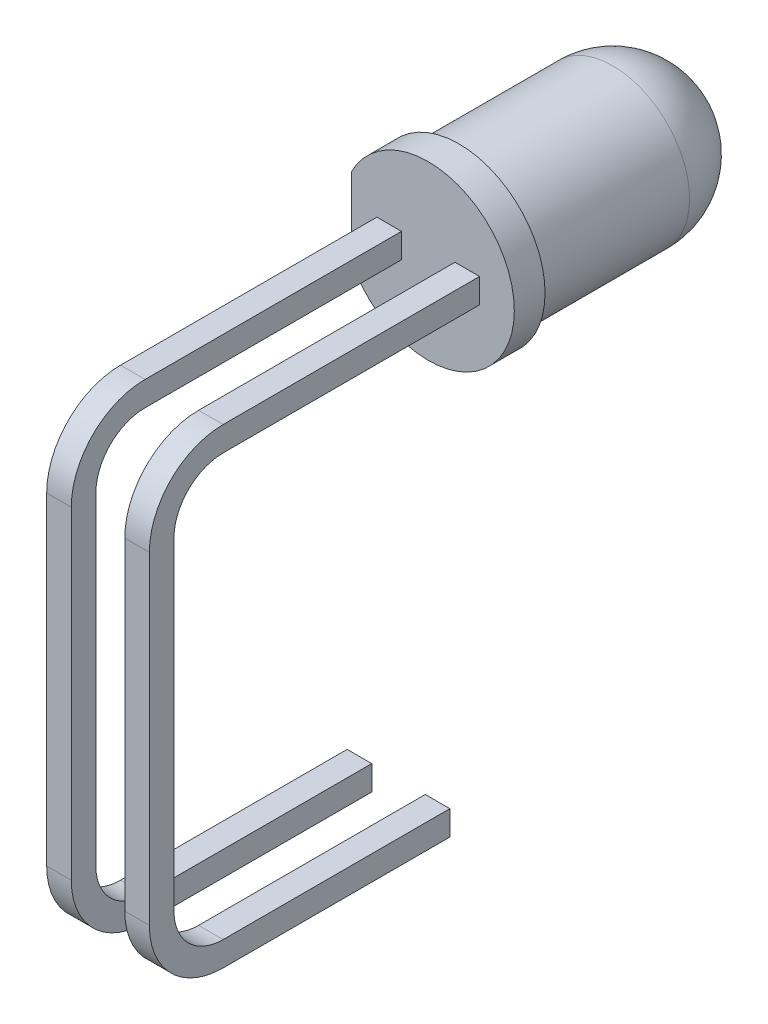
ISO-10303-21;
HEADER;
FILE_DESCRIPTION(('STEP AP214'),'2;1');
FILE_NAME('part.step','',(''),(''),'','','');
FILE_SCHEMA(('AUTOMOTIVE_DESIGN { 1 0 10303 214 1 1 1 1 }'));
ENDSEC;
DATA;
#1=APPLICATION_CONTEXT('core data for automotive mechanical design processes');
#2=APPLICATION_PROTOCOL_DEFINITION('international standard','automotive_design',2000,#1);
#3=PRODUCT_CONTEXT('',#1,'mechanical');
#4=PRODUCT('Part','Part','',(#3));
#5=PRODUCT_RELATED_PRODUCT_CATEGORY('part','',(#4));
#6=PRODUCT_DEFINITION_FORMATION('','',#4);
#7=PRODUCT_DEFINITION_CONTEXT('part definition',#1,'design');
#8=PRODUCT_DEFINITION('design','',#6,#7);
#9=PRODUCT_DEFINITION_SHAPE('','',#8);
#10=(LENGTH_UNIT() NAMED_UNIT(*) SI_UNIT(.MILLI.,.METRE.));
#11=(NAMED_UNIT(*) PLANE_ANGLE_UNIT() SI_UNIT($,.RADIAN.));
#12=(NAMED_UNIT(*) SI_UNIT($,.STERADIAN.) SOLID_ANGLE_UNIT());
#13=UNCERTAINTY_MEASURE_WITH_UNIT(LENGTH_MEASURE(1.E-05),#10,'distance_accuracy_value','');
#14=(GEOMETRIC_REPRESENTATION_CONTEXT(3) GLOBAL_UNCERTAINTY_ASSIGNED_CONTEXT((#13)) GLOBAL_UNIT_ASSIGNED_CONTEXT((#10,
#11,#12)) REPRESENTATION_CONTEXT('',''));
#15=CARTESIAN_POINT('',(0.,0.,0.));
#16=DIRECTION('',(0.,0.,1.));
#17=DIRECTION('',(1.,0.,0.));
#18=AXIS2_PLACEMENT_3D('',#15,#16,#17);
#19=CARTESIAN_POINT('',(0.,0.,8.5));
#20=DIRECTION('',(0.,0.,1.));
#21=DIRECTION('',(1.,0.,0.));
#22=AXIS2_PLACEMENT_3D('',#19,#20,#21);
#23=PLANE('',#22);
#24=DIRECTION('',(0.,-1.,0.));
#25=VECTOR('',#24,1.);
#26=CARTESIAN_POINT('',(-2.5,1.26095202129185,8.5));
#27=LINE('',#26,#25);
#28=CARTESIAN_POINT('',(-2.5,1.26095202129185,8.5));
#29=VERTEX_POINT('',#28);
#30=CARTESIAN_POINT('',(-2.5,-1.26095202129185,8.5));
#31=VERTEX_POINT('',#30);
#32=EDGE_CURVE('E424',#29,#31,#27,.T.);
#33=ORIENTED_EDGE('',*,*,#32,.T.);
#34=CARTESIAN_POINT('',(0.,0.,8.5));
#35=DIRECTION('',(0.,0.,1.));
#36=DIRECTION('',(1.,0.,0.));
#37=AXIS2_PLACEMENT_3D('',#34,#35,#36);
#38=CIRCLE('',#37,2.8);
#39=EDGE_CURVE('E421',#31,#29,#38,.T.);
#40=ORIENTED_EDGE('',*,*,#39,.T.);
#41=EDGE_LOOP('',(#33,#40));
#42=FACE_BOUND('',#41,.T.);
#43=DIRECTION('',(0.,1.,0.));
#44=VECTOR('',#43,1.);
#45=CARTESIAN_POINT('',(1.67,0.4,8.5));
#46=LINE('',#45,#44);
#47=CARTESIAN_POINT('',(1.67,-0.4,8.5));
#48=VERTEX_POINT('',#47);
#49=CARTESIAN_POINT('',(1.67,0.4,8.5));
#50=VERTEX_POINT('',#49);
#51=EDGE_CURVE('E49',#48,#50,#46,.T.);
#52=ORIENTED_EDGE('',*,*,#51,.F.);
#53=DIRECTION('',(1.,0.,0.));
#54=VECTOR('',#53,1.);
#55=CARTESIAN_POINT('',(0.870000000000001,-0.4,8.5));
#56=LINE('',#55,#54);
#57=CARTESIAN_POINT('',(0.870000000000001,-0.4,8.5));
#58=VERTEX_POINT('',#57);
#59=EDGE_CURVE('E323',#58,#48,#56,.T.);
#60=ORIENTED_EDGE('',*,*,#59,.F.);
#61=DIRECTION('',(0.,-1.,0.));
#62=VECTOR('',#61,1.);
#63=CARTESIAN_POINT('',(0.870000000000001,0.4,8.5));
#64=LINE('',#63,#62);
#65=CARTESIAN_POINT('',(0.870000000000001,0.4,8.5));
#66=VERTEX_POINT('',#65);
#67=EDGE_CURVE('E320',#66,#58,#64,.T.);
#68=ORIENTED_EDGE('',*,*,#67,.F.);
#69=DIRECTION('',(-1.,0.,0.));
#70=VECTOR('',#69,1.);
#71=CARTESIAN_POINT('',(0.870000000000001,0.4,8.5));
#72=LINE('',#71,#70);
#73=EDGE_CURVE('E317',#50,#66,#72,.T.);
#74=ORIENTED_EDGE('',*,*,#73,.F.);
#75=EDGE_LOOP('',(#52,#60,#68,#74));
#76=FACE_BOUND('',#75,.T.);
#77=DIRECTION('',(-1.,0.,0.));
#78=VECTOR('',#77,1.);
#79=CARTESIAN_POINT('',(-1.67,0.4,8.5));
#80=LINE('',#79,#78);
#81=CARTESIAN_POINT('',(-0.87,0.4,8.5));
#82=VERTEX_POINT('',#81);
#83=CARTESIAN_POINT('',(-1.67,0.4,8.5));
#84=VERTEX_POINT('',#83);
#85=EDGE_CURVE('E208',#82,#84,#80,.T.);
#86=ORIENTED_EDGE('',*,*,#85,.F.);
#87=DIRECTION('',(0.,1.,0.));
#88=VECTOR('',#87,1.);
#89=CARTESIAN_POINT('',(-0.87,0.4,8.5));
#90=LINE('',#89,#88);
#91=CARTESIAN_POINT('',(-0.869999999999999,-0.4,8.5));
#92=VERTEX_POINT('',#91);
#93=EDGE_CURVE('E219',#92,#82,#90,.T.);
#94=ORIENTED_EDGE('',*,*,#93,.F.);
#95=DIRECTION('',(1.,0.,0.));
#96=VECTOR('',#95,1.);
#97=CARTESIAN_POINT('',(-1.67,-0.4,8.5));
#98=LINE('',#97,#96);
#99=CARTESIAN_POINT('',(-1.67,-0.4,8.5));
#100=VERTEX_POINT('',#99);
#101=EDGE_CURVE('E229',#100,#92,#98,.T.);
#102=ORIENTED_EDGE('',*,*,#101,.F.);
#103=DIRECTION('',(0.,-1.,0.));
#104=VECTOR('',#103,1.);
#105=CARTESIAN_POINT('',(-1.67,0.4,8.5));
#106=LINE('',#105,#104);
#107=EDGE_CURVE('E227',#84,#100,#106,.T.);
#108=ORIENTED_EDGE('',*,*,#107,.F.);
#109=EDGE_LOOP('',(#86,#94,#102,#108));
#110=FACE_BOUND('',#109,.T.);
#111=ADVANCED_FACE('F26',(#42,#76,#110),#23,.T.);
#112=CARTESIAN_POINT('',(0.,0.,8.5));
#113=DIRECTION('',(0.,0.,-1.));
#114=DIRECTION('',(-1.,0.,0.));
#115=AXIS2_PLACEMENT_3D('',#112,#113,#114);
#116=CYLINDRICAL_SURFACE('',#115,2.5);
#117=CARTESIAN_POINT('',(0.,0.,2.5));
#118=DIRECTION('',(0.,0.,-1.));
#119=DIRECTION('',(-1.,0.,0.));
#120=AXIS2_PLACEMENT_3D('',#117,#118,#119);
#121=CIRCLE('',#120,2.5);
#122=CARTESIAN_POINT('',(-2.5,0.,2.5));
#123=VERTEX_POINT('',#122);
#124=EDGE_CURVE('E11',#123,#123,#121,.F.);
#125=ORIENTED_EDGE('',*,*,#124,.T.);
#126=EDGE_LOOP('',(#125));
#127=FACE_BOUND('',#126,.T.);
#128=CARTESIAN_POINT('',(0.,0.,7.5));
#129=DIRECTION('',(0.,0.,1.));
#130=DIRECTION('',(1.,0.,0.));
#131=AXIS2_PLACEMENT_3D('',#128,#129,#130);
#132=CIRCLE('',#131,2.5);
#133=CARTESIAN_POINT('',(-2.5,0.,7.5));
#134=VERTEX_POINT('',#133);
#135=EDGE_CURVE('E34',#134,#134,#132,.T.);
#136=ORIENTED_EDGE('',*,*,#135,.F.);
#137=EDGE_LOOP('',(#136));
#138=FACE_BOUND('',#137,.T.);
#139=ADVANCED_FACE('F28',(#127,#138),#116,.T.);
#140=CARTESIAN_POINT('',(0.,0.,7.5));
#141=DIRECTION('',(0.,0.,1.));
#142=DIRECTION('',(1.,0.,0.));
#143=AXIS2_PLACEMENT_3D('',#140,#141,#142);
#144=PLANE('',#143);
#145=DIRECTION('',(0.,-1.,0.));
#146=VECTOR('',#145,1.);
#147=CARTESIAN_POINT('',(-2.5,1.26095202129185,7.5));
#148=LINE('',#147,#146);
#149=CARTESIAN_POINT('',(-2.5,-1.26095202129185,7.5));
#150=VERTEX_POINT('',#149);
#151=EDGE_CURVE('E429',#134,#150,#148,.T.);
#152=ORIENTED_EDGE('',*,*,#151,.F.);
#153=ORIENTED_EDGE('',*,*,#135,.T.);
#154=CARTESIAN_POINT('',(-2.5,1.26095202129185,7.5));
#155=VERTEX_POINT('',#154);
#156=EDGE_CURVE('E430',#155,#134,#148,.T.);
#157=ORIENTED_EDGE('',*,*,#156,.F.);
#158=CARTESIAN_POINT('',(0.,0.,7.5));
#159=DIRECTION('',(0.,0.,1.));
#160=DIRECTION('',(1.,0.,0.));
#161=AXIS2_PLACEMENT_3D('',#158,#159,#160);
#162=CIRCLE('',#161,2.8);
#163=EDGE_CURVE('E426',#150,#155,#162,.T.);
#164=ORIENTED_EDGE('',*,*,#163,.F.);
#165=EDGE_LOOP('',(#152,#153,#157,#164));
#166=FACE_BOUND('',#165,.T.);
#167=ADVANCED_FACE('F441',(#166),#144,.F.);
#168=CARTESIAN_POINT('',(-2.5,1.26095202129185,7.5));
#169=DIRECTION('',(-1.,0.,0.));
#170=DIRECTION('',(0.,0.,1.));
#171=AXIS2_PLACEMENT_3D('',#168,#169,#170);
#172=PLANE('',#171);
#173=ORIENTED_EDGE('',*,*,#156,.T.);
#174=ORIENTED_EDGE('',*,*,#151,.T.);
#175=DIRECTION('',(0.,0.,1.));
#176=VECTOR('',#175,1.);
#177=CARTESIAN_POINT('',(-2.5,-1.26095202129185,7.5));
#178=LINE('',#177,#176);
#179=EDGE_CURVE('E434',#150,#31,#178,.T.);
#180=ORIENTED_EDGE('',*,*,#179,.T.);
#181=ORIENTED_EDGE('',*,*,#32,.F.);
#182=DIRECTION('',(0.,0.,1.));
#183=VECTOR('',#182,1.);
#184=CARTESIAN_POINT('',(-2.5,1.26095202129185,7.5));
#185=LINE('',#184,#183);
#186=EDGE_CURVE('E433',#155,#29,#185,.T.);
#187=ORIENTED_EDGE('',*,*,#186,.F.);
#188=EDGE_LOOP('',(#173,#174,#180,#181,#187));
#189=FACE_BOUND('',#188,.T.);
#190=ADVANCED_FACE('F451',(#189),#172,.T.);
#191=CARTESIAN_POINT('',(0.,0.,7.5));
#192=DIRECTION('',(0.,0.,1.));
#193=DIRECTION('',(1.,0.,0.));
#194=AXIS2_PLACEMENT_3D('',#191,#192,#193);
#195=CYLINDRICAL_SURFACE('',#194,2.8);
#196=ORIENTED_EDGE('',*,*,#39,.F.);
#197=ORIENTED_EDGE('',*,*,#179,.F.);
#198=ORIENTED_EDGE('',*,*,#163,.T.);
#199=ORIENTED_EDGE('',*,*,#186,.T.);
#200=EDGE_LOOP('',(#196,#197,#198,#199));
#201=FACE_BOUND('',#200,.T.);
#202=ADVANCED_FACE('F459',(#201),#195,.T.);
#203=CARTESIAN_POINT('',(0.,0.,2.5));
#204=DIRECTION('',(0.,0.,1.));
#205=DIRECTION('',(1.,0.,0.));
#206=AXIS2_PLACEMENT_3D('',#203,#204,#205);
#207=SPHERICAL_SURFACE('',#206,2.5);
#208=ORIENTED_EDGE('',*,*,#124,.F.);
#209=EDGE_LOOP('',(#208));
#210=FACE_BOUND('',#209,.T.);
#211=ADVANCED_FACE('F457',(#210),#207,.T.);
#212=CARTESIAN_POINT('',(0.870000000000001,-14.9079004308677,16.8399624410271));
#213=DIRECTION('',(0.,-1.,0.));
#214=DIRECTION('',(0.,0.,-1.));
#215=AXIS2_PLACEMENT_3D('',#212,#213,#214);
#216=PLANE('',#215);
#217=DIRECTION('',(-1.,0.,0.));
#218=VECTOR('',#217,1.);
#219=CARTESIAN_POINT('',(0.870000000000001,-14.9079004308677,16.8399624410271));
#220=LINE('',#219,#218);
#221=CARTESIAN_POINT('',(1.67,-14.9079004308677,16.8399624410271));
#222=VERTEX_POINT('',#221);
#223=CARTESIAN_POINT('',(0.870000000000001,-14.9079004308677,16.8399624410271));
#224=VERTEX_POINT('',#223);
#225=EDGE_CURVE('E382',#222,#224,#220,.T.);
#226=ORIENTED_EDGE('',*,*,#225,.T.);
#227=DIRECTION('',(0.,0.,-1.));
#228=VECTOR('',#227,1.);
#229=CARTESIAN_POINT('',(0.870000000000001,-14.9079004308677,16.8399624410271));
#230=LINE('',#229,#228);
#231=CARTESIAN_POINT('',(0.870000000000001,-14.9079004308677,9.46624016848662));
#232=VERTEX_POINT('',#231);
#233=EDGE_CURVE('E415',#224,#232,#230,.T.);
#234=ORIENTED_EDGE('',*,*,#233,.T.);
#235=DIRECTION('',(-1.,0.,0.));
#236=VECTOR('',#235,1.);
#237=CARTESIAN_POINT('',(0.870000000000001,-14.9079004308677,9.46624016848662));
#238=LINE('',#237,#236);
#239=CARTESIAN_POINT('',(1.67,-14.9079004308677,9.46624016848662));
#240=VERTEX_POINT('',#239);
#241=EDGE_CURVE('E406',#240,#232,#238,.T.);
#242=ORIENTED_EDGE('',*,*,#241,.F.);
#243=DIRECTION('',(0.,0.,-1.));
#244=VECTOR('',#243,1.);
#245=CARTESIAN_POINT('',(1.67,-14.9079004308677,16.8399624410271));
#246=LINE('',#245,#244);
#247=EDGE_CURVE('E418',#222,#240,#246,.T.);
#248=ORIENTED_EDGE('',*,*,#247,.F.);
#249=EDGE_LOOP('',(#226,#234,#242,#248));
#250=FACE_BOUND('',#249,.T.);
#251=ADVANCED_FACE('F458',(#250),#216,.T.);
#252=CARTESIAN_POINT('',(0.870000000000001,-14.1079004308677,16.8399624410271));
#253=DIRECTION('',(0.,1.,0.));
#254=DIRECTION('',(0.,0.,1.));
#255=AXIS2_PLACEMENT_3D('',#252,#253,#254);
#256=PLANE('',#255);
#257=DIRECTION('',(1.,0.,0.));
#258=VECTOR('',#257,1.);
#259=CARTESIAN_POINT('',(0.870000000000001,-14.1079004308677,16.8399624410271));
#260=LINE('',#259,#258);
#261=CARTESIAN_POINT('',(0.870000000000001,-14.1079004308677,16.8399624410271));
#262=VERTEX_POINT('',#261);
#263=CARTESIAN_POINT('',(1.67,-14.1079004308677,16.8399624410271));
#264=VERTEX_POINT('',#263);
#265=EDGE_CURVE('E379',#262,#264,#260,.T.);
#266=ORIENTED_EDGE('',*,*,#265,.T.);
#267=DIRECTION('',(0.,0.,-1.));
#268=VECTOR('',#267,1.);
#269=CARTESIAN_POINT('',(1.67,-14.1079004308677,16.8399624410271));
#270=LINE('',#269,#268);
#271=CARTESIAN_POINT('',(1.67,-14.1079004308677,9.46624016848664));
#272=VERTEX_POINT('',#271);
#273=EDGE_CURVE('E409',#264,#272,#270,.T.);
#274=ORIENTED_EDGE('',*,*,#273,.T.);
#275=DIRECTION('',(1.,0.,0.));
#276=VECTOR('',#275,1.);
#277=CARTESIAN_POINT('',(0.870000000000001,-14.1079004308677,9.46624016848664));
#278=LINE('',#277,#276);
#279=CARTESIAN_POINT('',(0.870000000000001,-14.1079004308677,9.46624016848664));
#280=VERTEX_POINT('',#279);
#281=EDGE_CURVE('E400',#280,#272,#278,.T.);
#282=ORIENTED_EDGE('',*,*,#281,.F.);
#283=DIRECTION('',(0.,0.,-1.));
#284=VECTOR('',#283,1.);
#285=CARTESIAN_POINT('',(0.870000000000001,-14.1079004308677,16.8399624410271));
#286=LINE('',#285,#284);
#287=EDGE_CURVE('E412',#262,#280,#286,.T.);
#288=ORIENTED_EDGE('',*,*,#287,.F.);
#289=EDGE_LOOP('',(#266,#274,#282,#288));
#290=FACE_BOUND('',#289,.T.);
#291=ADVANCED_FACE('F464',(#290),#256,.T.);
#292=CARTESIAN_POINT('',(1.27,-12.5079004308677,16.8399624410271));
#293=DIRECTION('',(1.,0.,0.));
#294=DIRECTION('',(0.,0.,-1.));
#295=AXIS2_PLACEMENT_3D('',#292,#293,#294);
#296=CYLINDRICAL_SURFACE('',#295,2.4);
#297=DIRECTION('',(-1.,0.,0.));
#298=VECTOR('',#297,1.);
#299=CARTESIAN_POINT('',(0.870000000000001,-12.5079004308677,19.2399624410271));
#300=LINE('',#299,#298);
#301=CARTESIAN_POINT('',(1.67,-12.5079004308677,19.2399624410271));
#302=VERTEX_POINT('',#301);
#303=CARTESIAN_POINT('',(0.870000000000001,-12.5079004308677,19.2399624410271));
#304=VERTEX_POINT('',#303);
#305=EDGE_CURVE('E364',#302,#304,#300,.T.);
#306=ORIENTED_EDGE('',*,*,#305,.T.);
#307=CARTESIAN_POINT('',(0.870000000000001,-12.5079004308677,16.8399624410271));
#308=DIRECTION('',(1.,0.,0.));
#309=DIRECTION('',(0.,0.,-1.));
#310=AXIS2_PLACEMENT_3D('',#307,#308,#309);
#311=CIRCLE('',#310,2.4);
#312=EDGE_CURVE('E391',#304,#224,#311,.T.);
#313=ORIENTED_EDGE('',*,*,#312,.T.);
#314=ORIENTED_EDGE('',*,*,#225,.F.);
#315=CARTESIAN_POINT('',(1.67,-12.5079004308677,16.8399624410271));
#316=DIRECTION('',(1.,0.,0.));
#317=DIRECTION('',(0.,0.,-1.));
#318=AXIS2_PLACEMENT_3D('',#315,#316,#317);
#319=CIRCLE('',#318,2.4);
#320=EDGE_CURVE('E394',#302,#222,#319,.T.);
#321=ORIENTED_EDGE('',*,*,#320,.F.);
#322=EDGE_LOOP('',(#306,#313,#314,#321));
#323=FACE_BOUND('',#322,.T.);
#324=ADVANCED_FACE('F497',(#323),#296,.T.);
#325=CARTESIAN_POINT('',(1.27,-12.5079004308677,16.8399624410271));
#326=DIRECTION('',(1.,0.,0.));
#327=DIRECTION('',(0.,0.,-1.));
#328=AXIS2_PLACEMENT_3D('',#325,#326,#327);
#329=CYLINDRICAL_SURFACE('',#328,1.59999999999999);
#330=DIRECTION('',(1.,0.,0.));
#331=VECTOR('',#330,1.);
#332=CARTESIAN_POINT('',(0.870000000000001,-12.5079004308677,18.4399624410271));
#333=LINE('',#332,#331);
#334=CARTESIAN_POINT('',(0.870000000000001,-12.5079004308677,18.4399624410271));
#335=VERTEX_POINT('',#334);
#336=CARTESIAN_POINT('',(1.67,-12.5079004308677,18.4399624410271));
#337=VERTEX_POINT('',#336);
#338=EDGE_CURVE('E361',#335,#337,#333,.T.);
#339=ORIENTED_EDGE('',*,*,#338,.T.);
#340=CARTESIAN_POINT('',(1.67,-12.5079004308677,16.8399624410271));
#341=DIRECTION('',(1.,0.,0.));
#342=DIRECTION('',(0.,0.,-1.));
#343=AXIS2_PLACEMENT_3D('',#340,#341,#342);
#344=CIRCLE('',#343,1.59999999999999);
#345=EDGE_CURVE('E385',#337,#264,#344,.T.);
#346=ORIENTED_EDGE('',*,*,#345,.T.);
#347=ORIENTED_EDGE('',*,*,#265,.F.);
#348=CARTESIAN_POINT('',(0.870000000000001,-12.5079004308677,16.8399624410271));
#349=DIRECTION('',(1.,0.,0.));
#350=DIRECTION('',(0.,0.,-1.));
#351=AXIS2_PLACEMENT_3D('',#348,#349,#350);
#352=CIRCLE('',#351,1.59999999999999);
#353=EDGE_CURVE('E388',#335,#262,#352,.T.);
#354=ORIENTED_EDGE('',*,*,#353,.F.);
#355=EDGE_LOOP('',(#339,#346,#347,#354));
#356=FACE_BOUND('',#355,.T.);
#357=ADVANCED_FACE('F504',(#356),#329,.F.);
#358=CARTESIAN_POINT('',(0.870000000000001,-2.,19.2399624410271));
#359=DIRECTION('',(0.,0.,1.));
#360=DIRECTION('',(1.,0.,0.));
#361=AXIS2_PLACEMENT_3D('',#358,#359,#360);
#362=PLANE('',#361);
#363=DIRECTION('',(-1.,0.,0.));
#364=VECTOR('',#363,1.);
#365=CARTESIAN_POINT('',(0.870000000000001,-2.,19.2399624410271));
#366=LINE('',#365,#364);
#367=CARTESIAN_POINT('',(1.67,-2.,19.2399624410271));
#368=VERTEX_POINT('',#367);
#369=CARTESIAN_POINT('',(0.870000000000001,-2.,19.2399624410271));
#370=VERTEX_POINT('',#369);
#371=EDGE_CURVE('E346',#368,#370,#366,.T.);
#372=ORIENTED_EDGE('',*,*,#371,.T.);
#373=DIRECTION('',(0.,-1.,0.));
#374=VECTOR('',#373,1.);
#375=CARTESIAN_POINT('',(0.870000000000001,-2.,19.2399624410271));
#376=LINE('',#375,#374);
#377=EDGE_CURVE('E373',#370,#304,#376,.T.);
#378=ORIENTED_EDGE('',*,*,#377,.T.);
#379=ORIENTED_EDGE('',*,*,#305,.F.);
#380=DIRECTION('',(0.,-1.,0.));
#381=VECTOR('',#380,1.);
#382=CARTESIAN_POINT('',(1.67,-2.,19.2399624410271));
#383=LINE('',#382,#381);
#384=EDGE_CURVE('E376',#368,#302,#383,.T.);
#385=ORIENTED_EDGE('',*,*,#384,.F.);
#386=EDGE_LOOP('',(#372,#378,#379,#385));
#387=FACE_BOUND('',#386,.T.);
#388=ADVANCED_FACE('F512',(#387),#362,.T.);
#389=CARTESIAN_POINT('',(0.870000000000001,-2.,18.4399624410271));
#390=DIRECTION('',(0.,0.,-1.));
#391=DIRECTION('',(-1.,0.,0.));
#392=AXIS2_PLACEMENT_3D('',#389,#390,#391);
#393=PLANE('',#392);
#394=DIRECTION('',(1.,0.,0.));
#395=VECTOR('',#394,1.);
#396=CARTESIAN_POINT('',(0.870000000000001,-2.,18.4399624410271));
#397=LINE('',#396,#395);
#398=CARTESIAN_POINT('',(0.870000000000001,-2.,18.4399624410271));
#399=VERTEX_POINT('',#398);
#400=CARTESIAN_POINT('',(1.67,-2.,18.4399624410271));
#401=VERTEX_POINT('',#400);
#402=EDGE_CURVE('E343',#399,#401,#397,.T.);
#403=ORIENTED_EDGE('',*,*,#402,.T.);
#404=DIRECTION('',(0.,-1.,0.));
#405=VECTOR('',#404,1.);
#406=CARTESIAN_POINT('',(1.67,-2.,18.4399624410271));
#407=LINE('',#406,#405);
#408=EDGE_CURVE('E367',#401,#337,#407,.T.);
#409=ORIENTED_EDGE('',*,*,#408,.T.);
#410=ORIENTED_EDGE('',*,*,#338,.F.);
#411=DIRECTION('',(0.,-1.,0.));
#412=VECTOR('',#411,1.);
#413=CARTESIAN_POINT('',(0.870000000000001,-2.,18.4399624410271));
#414=LINE('',#413,#412);
#415=EDGE_CURVE('E370',#399,#335,#414,.T.);
#416=ORIENTED_EDGE('',*,*,#415,.F.);
#417=EDGE_LOOP('',(#403,#409,#410,#416));
#418=FACE_BOUND('',#417,.T.);
#419=ADVANCED_FACE('F520',(#418),#393,.T.);
#420=CARTESIAN_POINT('',(1.27,-2.,16.8399624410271));
#421=DIRECTION('',(1.,0.,0.));
#422=DIRECTION('',(0.,0.,-1.));
#423=AXIS2_PLACEMENT_3D('',#420,#421,#422);
#424=CYLINDRICAL_SURFACE('',#423,2.4);
#425=DIRECTION('',(-1.,0.,0.));
#426=VECTOR('',#425,1.);
#427=CARTESIAN_POINT('',(0.870000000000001,0.399999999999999,16.8399624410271));
#428=LINE('',#427,#426);
#429=CARTESIAN_POINT('',(1.67,0.399999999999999,16.8399624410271));
#430=VERTEX_POINT('',#429);
#431=CARTESIAN_POINT('',(0.870000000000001,0.399999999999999,16.8399624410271));
#432=VERTEX_POINT('',#431);
#433=EDGE_CURVE('E325',#430,#432,#428,.T.);
#434=ORIENTED_EDGE('',*,*,#433,.T.);
#435=CARTESIAN_POINT('',(0.870000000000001,-2.,16.8399624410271));
#436=DIRECTION('',(1.,0.,0.));
#437=DIRECTION('',(0.,0.,-1.));
#438=AXIS2_PLACEMENT_3D('',#435,#436,#437);
#439=CIRCLE('',#438,2.4);
#440=EDGE_CURVE('E355',#432,#370,#439,.T.);
#441=ORIENTED_EDGE('',*,*,#440,.T.);
#442=ORIENTED_EDGE('',*,*,#371,.F.);
#443=CARTESIAN_POINT('',(1.67,-2.,16.8399624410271));
#444=DIRECTION('',(1.,0.,0.));
#445=DIRECTION('',(0.,0.,-1.));
#446=AXIS2_PLACEMENT_3D('',#443,#444,#445);
#447=CIRCLE('',#446,2.4);
#448=EDGE_CURVE('E358',#430,#368,#447,.T.);
#449=ORIENTED_EDGE('',*,*,#448,.F.);
#450=EDGE_LOOP('',(#434,#441,#442,#449));
#451=FACE_BOUND('',#450,.T.);
#452=ADVANCED_FACE('F528',(#451),#424,.T.);
#453=CARTESIAN_POINT('',(1.27,-2.,16.8399624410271));
#454=DIRECTION('',(1.,0.,0.));
#455=DIRECTION('',(0.,0.,-1.));
#456=AXIS2_PLACEMENT_3D('',#453,#454,#455);
#457=CYLINDRICAL_SURFACE('',#456,1.6);
#458=DIRECTION('',(1.,0.,0.));
#459=VECTOR('',#458,1.);
#460=CARTESIAN_POINT('',(0.870000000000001,-0.400000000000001,16.8399624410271));
#461=LINE('',#460,#459);
#462=CARTESIAN_POINT('',(0.870000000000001,-0.400000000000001,16.8399624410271));
#463=VERTEX_POINT('',#462);
#464=CARTESIAN_POINT('',(1.67,-0.400000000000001,16.8399624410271));
#465=VERTEX_POINT('',#464);
#466=EDGE_CURVE('E328',#463,#465,#461,.T.);
#467=ORIENTED_EDGE('',*,*,#466,.T.);
#468=CARTESIAN_POINT('',(1.67,-2.,16.8399624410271));
#469=DIRECTION('',(1.,0.,0.));
#470=DIRECTION('',(0.,0.,-1.));
#471=AXIS2_PLACEMENT_3D('',#468,#469,#470);
#472=CIRCLE('',#471,1.6);
#473=EDGE_CURVE('E349',#465,#401,#472,.T.);
#474=ORIENTED_EDGE('',*,*,#473,.T.);
#475=ORIENTED_EDGE('',*,*,#402,.F.);
#476=CARTESIAN_POINT('',(0.870000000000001,-2.,16.8399624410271));
#477=DIRECTION('',(1.,0.,0.));
#478=DIRECTION('',(0.,0.,-1.));
#479=AXIS2_PLACEMENT_3D('',#476,#477,#478);
#480=CIRCLE('',#479,1.6);
#481=EDGE_CURVE('E352',#463,#399,#480,.T.);
#482=ORIENTED_EDGE('',*,*,#481,.F.);
#483=EDGE_LOOP('',(#467,#474,#475,#482));
#484=FACE_BOUND('',#483,.T.);
#485=ADVANCED_FACE('F536',(#484),#457,.F.);
#486=CARTESIAN_POINT('',(1.67,0.399999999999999,16.8399624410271));
#487=DIRECTION('',(-1.,0.,0.));
#488=DIRECTION('',(0.,-1.,0.));
#489=AXIS2_PLACEMENT_3D('',#486,#487,#488);
#490=PLANE('',#489);
#491=ORIENTED_EDGE('',*,*,#51,.T.);
#492=DIRECTION('',(0.,0.,-1.));
#493=VECTOR('',#492,1.);
#494=CARTESIAN_POINT('',(1.67,0.399999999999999,16.8399624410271));
#495=LINE('',#494,#493);
#496=EDGE_CURVE('E340',#430,#50,#495,.T.);
#497=ORIENTED_EDGE('',*,*,#496,.F.);
#498=ORIENTED_EDGE('',*,*,#448,.T.);
#499=ORIENTED_EDGE('',*,*,#384,.T.);
#500=ORIENTED_EDGE('',*,*,#320,.T.);
#501=ORIENTED_EDGE('',*,*,#247,.T.);
#502=DIRECTION('',(0.,-1.,0.));
#503=VECTOR('',#502,1.);
#504=CARTESIAN_POINT('',(1.67,-14.9079004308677,9.46624016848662));
#505=LINE('',#504,#503);
#506=EDGE_CURVE('E397',#272,#240,#505,.T.);
#507=ORIENTED_EDGE('',*,*,#506,.F.);
#508=ORIENTED_EDGE('',*,*,#273,.F.);
#509=ORIENTED_EDGE('',*,*,#345,.F.);
#510=ORIENTED_EDGE('',*,*,#408,.F.);
#511=ORIENTED_EDGE('',*,*,#473,.F.);
#512=DIRECTION('',(0.,0.,-1.));
#513=VECTOR('',#512,1.);
#514=CARTESIAN_POINT('',(1.67,-0.400000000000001,16.8399624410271));
#515=LINE('',#514,#513);
#516=EDGE_CURVE('E331',#465,#48,#515,.T.);
#517=ORIENTED_EDGE('',*,*,#516,.T.);
#518=EDGE_LOOP('',(#491,#497,#498,#499,#500,#501,#507,#508,#509,#510,#511,#517));
#519=FACE_BOUND('',#518,.T.);
#520=ADVANCED_FACE('F544',(#519),#490,.F.);
#521=CARTESIAN_POINT('',(0.870000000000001,0.399999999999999,16.8399624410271));
#522=DIRECTION('',(0.,-1.,0.));
#523=DIRECTION('',(0.,0.,-1.));
#524=AXIS2_PLACEMENT_3D('',#521,#522,#523);
#525=PLANE('',#524);
#526=ORIENTED_EDGE('',*,*,#73,.T.);
#527=DIRECTION('',(0.,0.,-1.));
#528=VECTOR('',#527,1.);
#529=CARTESIAN_POINT('',(0.870000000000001,0.399999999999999,16.8399624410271));
#530=LINE('',#529,#528);
#531=EDGE_CURVE('E337',#432,#66,#530,.T.);
#532=ORIENTED_EDGE('',*,*,#531,.F.);
#533=ORIENTED_EDGE('',*,*,#433,.F.);
#534=ORIENTED_EDGE('',*,*,#496,.T.);
#535=EDGE_LOOP('',(#526,#532,#533,#534));
#536=FACE_BOUND('',#535,.T.);
#537=ADVANCED_FACE('F552',(#536),#525,.F.);
#538=CARTESIAN_POINT('',(0.870000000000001,0.399999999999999,16.8399624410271));
#539=DIRECTION('',(1.,0.,0.));
#540=DIRECTION('',(0.,1.,0.));
#541=AXIS2_PLACEMENT_3D('',#538,#539,#540);
#542=PLANE('',#541);
#543=ORIENTED_EDGE('',*,*,#67,.T.);
#544=DIRECTION('',(0.,0.,-1.));
#545=VECTOR('',#544,1.);
#546=CARTESIAN_POINT('',(0.870000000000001,-0.400000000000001,16.8399624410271));
#547=LINE('',#546,#545);
#548=EDGE_CURVE('E334',#463,#58,#547,.T.);
#549=ORIENTED_EDGE('',*,*,#548,.F.);
#550=ORIENTED_EDGE('',*,*,#481,.T.);
#551=ORIENTED_EDGE('',*,*,#415,.T.);
#552=ORIENTED_EDGE('',*,*,#353,.T.);
#553=ORIENTED_EDGE('',*,*,#287,.T.);
#554=DIRECTION('',(0.,1.,0.));
#555=VECTOR('',#554,1.);
#556=CARTESIAN_POINT('',(0.870000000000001,-14.9079004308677,9.46624016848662));
#557=LINE('',#556,#555);
#558=EDGE_CURVE('E403',#232,#280,#557,.T.);
#559=ORIENTED_EDGE('',*,*,#558,.F.);
#560=ORIENTED_EDGE('',*,*,#233,.F.);
#561=ORIENTED_EDGE('',*,*,#312,.F.);
#562=ORIENTED_EDGE('',*,*,#377,.F.);
#563=ORIENTED_EDGE('',*,*,#440,.F.);
#564=ORIENTED_EDGE('',*,*,#531,.T.);
#565=EDGE_LOOP('',(#543,#549,#550,#551,#552,#553,#559,#560,#561,#562,#563,#564));
#566=FACE_BOUND('',#565,.T.);
#567=ADVANCED_FACE('F572',(#566),#542,.F.);
#568=CARTESIAN_POINT('',(0.870000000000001,-0.400000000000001,16.8399624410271));
#569=DIRECTION('',(0.,1.,0.));
#570=DIRECTION('',(0.,0.,1.));
#571=AXIS2_PLACEMENT_3D('',#568,#569,#570);
#572=PLANE('',#571);
#573=ORIENTED_EDGE('',*,*,#59,.T.);
#574=ORIENTED_EDGE('',*,*,#516,.F.);
#575=ORIENTED_EDGE('',*,*,#466,.F.);
#576=ORIENTED_EDGE('',*,*,#548,.T.);
#577=EDGE_LOOP('',(#573,#574,#575,#576));
#578=FACE_BOUND('',#577,.T.);
#579=ADVANCED_FACE('F580',(#578),#572,.F.);
#580=CARTESIAN_POINT('',(1.67,-14.9079004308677,9.46624016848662));
#581=DIRECTION('',(0.,0.,-1.));
#582=DIRECTION('',(1.,0.,0.));
#583=AXIS2_PLACEMENT_3D('',#580,#581,#582);
#584=PLANE('',#583);
#585=ORIENTED_EDGE('',*,*,#506,.T.);
#586=ORIENTED_EDGE('',*,*,#241,.T.);
#587=ORIENTED_EDGE('',*,*,#558,.T.);
#588=ORIENTED_EDGE('',*,*,#281,.T.);
#589=EDGE_LOOP('',(#585,#586,#587,#588));
#590=FACE_BOUND('',#589,.T.);
#591=ADVANCED_FACE('F600',(#590),#584,.T.);
#592=CARTESIAN_POINT('',(-1.67,-14.9079004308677,16.8399624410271));
#593=DIRECTION('',(0.,-1.,0.));
#594=DIRECTION('',(0.,0.,-1.));
#595=AXIS2_PLACEMENT_3D('',#592,#593,#594);
#596=PLANE('',#595);
#597=DIRECTION('',(-1.,0.,0.));
#598=VECTOR('',#597,1.);
#599=CARTESIAN_POINT('',(-1.67,-14.9079004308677,16.8399624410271));
#600=LINE('',#599,#598);
#601=CARTESIAN_POINT('',(-0.87,-14.9079004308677,16.8399624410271));
#602=VERTEX_POINT('',#601);
#603=CARTESIAN_POINT('',(-1.67,-14.9079004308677,16.8399624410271));
#604=VERTEX_POINT('',#603);
#605=EDGE_CURVE('E277',#602,#604,#600,.T.);
#606=ORIENTED_EDGE('',*,*,#605,.T.);
#607=DIRECTION('',(0.,0.,-1.));
#608=VECTOR('',#607,1.);
#609=CARTESIAN_POINT('',(-1.67,-14.9079004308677,16.8399624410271));
#610=LINE('',#609,#608);
#611=CARTESIAN_POINT('',(-1.67,-14.9079004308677,9.46624016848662));
#612=VERTEX_POINT('',#611);
#613=EDGE_CURVE('E310',#604,#612,#610,.T.);
#614=ORIENTED_EDGE('',*,*,#613,.T.);
#615=DIRECTION('',(-1.,0.,0.));
#616=VECTOR('',#615,1.);
#617=CARTESIAN_POINT('',(-1.67,-14.9079004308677,9.46624016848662));
#618=LINE('',#617,#616);
#619=CARTESIAN_POINT('',(-0.87,-14.9079004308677,9.46624016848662));
#620=VERTEX_POINT('',#619);
#621=EDGE_CURVE('E301',#620,#612,#618,.T.);
#622=ORIENTED_EDGE('',*,*,#621,.F.);
#623=DIRECTION('',(0.,0.,-1.));
#624=VECTOR('',#623,1.);
#625=CARTESIAN_POINT('',(-0.87,-14.9079004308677,16.8399624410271));
#626=LINE('',#625,#624);
#627=EDGE_CURVE('E313',#602,#620,#626,.T.);
#628=ORIENTED_EDGE('',*,*,#627,.F.);
#629=EDGE_LOOP('',(#606,#614,#622,#628));
#630=FACE_BOUND('',#629,.T.);
#631=ADVANCED_FACE('F608',(#630),#596,.T.);
#632=CARTESIAN_POINT('',(-1.67,-14.1079004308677,16.8399624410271));
#633=DIRECTION('',(0.,1.,0.));
#634=DIRECTION('',(0.,0.,1.));
#635=AXIS2_PLACEMENT_3D('',#632,#633,#634);
#636=PLANE('',#635);
#637=DIRECTION('',(1.,0.,0.));
#638=VECTOR('',#637,1.);
#639=CARTESIAN_POINT('',(-1.67,-14.1079004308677,16.8399624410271));
#640=LINE('',#639,#638);
#641=CARTESIAN_POINT('',(-1.67,-14.1079004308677,16.8399624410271));
#642=VERTEX_POINT('',#641);
#643=CARTESIAN_POINT('',(-0.869999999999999,-14.1079004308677,16.8399624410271));
#644=VERTEX_POINT('',#643);
#645=EDGE_CURVE('E274',#642,#644,#640,.T.);
#646=ORIENTED_EDGE('',*,*,#645,.T.);
#647=DIRECTION('',(0.,0.,-1.));
#648=VECTOR('',#647,1.);
#649=CARTESIAN_POINT('',(-0.869999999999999,-14.1079004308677,16.8399624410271));
#650=LINE('',#649,#648);
#651=CARTESIAN_POINT('',(-0.869999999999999,-14.1079004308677,9.46624016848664));
#652=VERTEX_POINT('',#651);
#653=EDGE_CURVE('E304',#644,#652,#650,.T.);
#654=ORIENTED_EDGE('',*,*,#653,.T.);
#655=DIRECTION('',(1.,0.,0.));
#656=VECTOR('',#655,1.);
#657=CARTESIAN_POINT('',(-1.67,-14.1079004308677,9.46624016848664));
#658=LINE('',#657,#656);
#659=CARTESIAN_POINT('',(-1.67,-14.1079004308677,9.46624016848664));
#660=VERTEX_POINT('',#659);
#661=EDGE_CURVE('E295',#660,#652,#658,.T.);
#662=ORIENTED_EDGE('',*,*,#661,.F.);
#663=DIRECTION('',(0.,0.,-1.));
#664=VECTOR('',#663,1.);
#665=CARTESIAN_POINT('',(-1.67,-14.1079004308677,16.8399624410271));
#666=LINE('',#665,#664);
#667=EDGE_CURVE('E307',#642,#660,#666,.T.);
#668=ORIENTED_EDGE('',*,*,#667,.F.);
#669=EDGE_LOOP('',(#646,#654,#662,#668));
#670=FACE_BOUND('',#669,.T.);
#671=ADVANCED_FACE('F623',(#670),#636,.T.);
#672=CARTESIAN_POINT('',(-1.27,-12.5079004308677,16.8399624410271));
#673=DIRECTION('',(1.,0.,0.));
#674=DIRECTION('',(0.,0.,-1.));
#675=AXIS2_PLACEMENT_3D('',#672,#673,#674);
#676=CYLINDRICAL_SURFACE('',#675,2.4);
#677=DIRECTION('',(-1.,0.,0.));
#678=VECTOR('',#677,1.);
#679=CARTESIAN_POINT('',(-1.67,-12.5079004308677,19.2399624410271));
#680=LINE('',#679,#678);
#681=CARTESIAN_POINT('',(-0.87,-12.5079004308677,19.2399624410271));
#682=VERTEX_POINT('',#681);
#683=CARTESIAN_POINT('',(-1.67,-12.5079004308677,19.2399624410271));
#684=VERTEX_POINT('',#683);
#685=EDGE_CURVE('E259',#682,#684,#680,.T.);
#686=ORIENTED_EDGE('',*,*,#685,.T.);
#687=CARTESIAN_POINT('',(-1.67,-12.5079004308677,16.8399624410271));
#688=DIRECTION('',(1.,0.,0.));
#689=DIRECTION('',(0.,0.,-1.));
#690=AXIS2_PLACEMENT_3D('',#687,#688,#689);
#691=CIRCLE('',#690,2.4);
#692=EDGE_CURVE('E286',#684,#604,#691,.T.);
#693=ORIENTED_EDGE('',*,*,#692,.T.);
#694=ORIENTED_EDGE('',*,*,#605,.F.);
#695=CARTESIAN_POINT('',(-0.87,-12.5079004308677,16.8399624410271));
#696=DIRECTION('',(1.,0.,0.));
#697=DIRECTION('',(0.,0.,-1.));
#698=AXIS2_PLACEMENT_3D('',#695,#696,#697);
#699=CIRCLE('',#698,2.4);
#700=EDGE_CURVE('E289',#682,#602,#699,.T.);
#701=ORIENTED_EDGE('',*,*,#700,.F.);
#702=EDGE_LOOP('',(#686,#693,#694,#701));
#703=FACE_BOUND('',#702,.T.);
#704=ADVANCED_FACE('F631',(#703),#676,.T.);
#705=CARTESIAN_POINT('',(-1.27,-12.5079004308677,16.8399624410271));
#706=DIRECTION('',(1.,0.,0.));
#707=DIRECTION('',(0.,0.,-1.));
#708=AXIS2_PLACEMENT_3D('',#705,#706,#707);
#709=CYLINDRICAL_SURFACE('',#708,1.59999999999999);
#710=DIRECTION('',(1.,0.,0.));
#711=VECTOR('',#710,1.);
#712=CARTESIAN_POINT('',(-1.67,-12.5079004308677,18.4399624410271));
#713=LINE('',#712,#711);
#714=CARTESIAN_POINT('',(-1.67,-12.5079004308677,18.4399624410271));
#715=VERTEX_POINT('',#714);
#716=CARTESIAN_POINT('',(-0.869999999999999,-12.5079004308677,18.4399624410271));
#717=VERTEX_POINT('',#716);
#718=EDGE_CURVE('E256',#715,#717,#713,.T.);
#719=ORIENTED_EDGE('',*,*,#718,.T.);
#720=CARTESIAN_POINT('',(-0.869999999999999,-12.5079004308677,16.8399624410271));
#721=DIRECTION('',(1.,0.,0.));
#722=DIRECTION('',(0.,0.,-1.));
#723=AXIS2_PLACEMENT_3D('',#720,#721,#722);
#724=CIRCLE('',#723,1.59999999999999);
#725=EDGE_CURVE('E280',#717,#644,#724,.T.);
#726=ORIENTED_EDGE('',*,*,#725,.T.);
#727=ORIENTED_EDGE('',*,*,#645,.F.);
#728=CARTESIAN_POINT('',(-1.67,-12.5079004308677,16.8399624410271));
#729=DIRECTION('',(1.,0.,0.));
#730=DIRECTION('',(0.,0.,-1.));
#731=AXIS2_PLACEMENT_3D('',#728,#729,#730);
#732=CIRCLE('',#731,1.59999999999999);
#733=EDGE_CURVE('E283',#715,#642,#732,.T.);
#734=ORIENTED_EDGE('',*,*,#733,.F.);
#735=EDGE_LOOP('',(#719,#726,#727,#734));
#736=FACE_BOUND('',#735,.T.);
#737=ADVANCED_FACE('F639',(#736),#709,.F.);
#738=CARTESIAN_POINT('',(-1.67,-2.,19.2399624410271));
#739=DIRECTION('',(0.,0.,1.));
#740=DIRECTION('',(1.,0.,0.));
#741=AXIS2_PLACEMENT_3D('',#738,#739,#740);
#742=PLANE('',#741);
#743=DIRECTION('',(-1.,0.,0.));
#744=VECTOR('',#743,1.);
#745=CARTESIAN_POINT('',(-1.67,-2.,19.2399624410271));
#746=LINE('',#745,#744);
#747=CARTESIAN_POINT('',(-0.87,-2.,19.2399624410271));
#748=VERTEX_POINT('',#747);
#749=CARTESIAN_POINT('',(-1.67,-2.,19.2399624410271));
#750=VERTEX_POINT('',#749);
#751=EDGE_CURVE('E242',#748,#750,#746,.T.);
#752=ORIENTED_EDGE('',*,*,#751,.T.);
#753=DIRECTION('',(0.,-1.,0.));
#754=VECTOR('',#753,1.);
#755=CARTESIAN_POINT('',(-1.67,-2.,19.2399624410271));
#756=LINE('',#755,#754);
#757=EDGE_CURVE('E268',#750,#684,#756,.T.);
#758=ORIENTED_EDGE('',*,*,#757,.T.);
#759=ORIENTED_EDGE('',*,*,#685,.F.);
#760=DIRECTION('',(0.,-1.,0.));
#761=VECTOR('',#760,1.);
#762=CARTESIAN_POINT('',(-0.87,-2.,19.2399624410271));
#763=LINE('',#762,#761);
#764=EDGE_CURVE('E271',#748,#682,#763,.T.);
#765=ORIENTED_EDGE('',*,*,#764,.F.);
#766=EDGE_LOOP('',(#752,#758,#759,#765));
#767=FACE_BOUND('',#766,.T.);
#768=ADVANCED_FACE('F647',(#767),#742,.T.);
#769=CARTESIAN_POINT('',(-1.67,-2.,18.4399624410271));
#770=DIRECTION('',(0.,0.,-1.));
#771=DIRECTION('',(-1.,0.,0.));
#772=AXIS2_PLACEMENT_3D('',#769,#770,#771);
#773=PLANE('',#772);
#774=DIRECTION('',(1.,0.,0.));
#775=VECTOR('',#774,1.);
#776=CARTESIAN_POINT('',(-1.67,-2.,18.4399624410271));
#777=LINE('',#776,#775);
#778=CARTESIAN_POINT('',(-1.67,-2.,18.4399624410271));
#779=VERTEX_POINT('',#778);
#780=CARTESIAN_POINT('',(-0.869999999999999,-2.,18.4399624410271));
#781=VERTEX_POINT('',#780);
#782=EDGE_CURVE('E214',#779,#781,#777,.T.);
#783=ORIENTED_EDGE('',*,*,#782,.T.);
#784=DIRECTION('',(0.,-1.,0.));
#785=VECTOR('',#784,1.);
#786=CARTESIAN_POINT('',(-0.869999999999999,-2.,18.4399624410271));
#787=LINE('',#786,#785);
#788=EDGE_CURVE('E262',#781,#717,#787,.T.);
#789=ORIENTED_EDGE('',*,*,#788,.T.);
#790=ORIENTED_EDGE('',*,*,#718,.F.);
#791=DIRECTION('',(0.,-1.,0.));
#792=VECTOR('',#791,1.);
#793=CARTESIAN_POINT('',(-1.67,-2.,18.4399624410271));
#794=LINE('',#793,#792);
#795=EDGE_CURVE('E265',#779,#715,#794,.T.);
#796=ORIENTED_EDGE('',*,*,#795,.F.);
#797=EDGE_LOOP('',(#783,#789,#790,#796));
#798=FACE_BOUND('',#797,.T.);
#799=ADVANCED_FACE('F655',(#798),#773,.T.);
#800=CARTESIAN_POINT('',(-1.27,-2.,16.8399624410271));
#801=DIRECTION('',(1.,0.,0.));
#802=DIRECTION('',(0.,0.,-1.));
#803=AXIS2_PLACEMENT_3D('',#800,#801,#802);
#804=CYLINDRICAL_SURFACE('',#803,2.4);
#805=DIRECTION('',(-1.,0.,0.));
#806=VECTOR('',#805,1.);
#807=CARTESIAN_POINT('',(-1.67,0.399999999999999,16.8399624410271));
#808=LINE('',#807,#806);
#809=CARTESIAN_POINT('',(-0.87,0.399999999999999,16.8399624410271));
#810=VERTEX_POINT('',#809);
#811=CARTESIAN_POINT('',(-1.67,0.399999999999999,16.8399624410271));
#812=VERTEX_POINT('',#811);
#813=EDGE_CURVE('E211',#810,#812,#808,.T.);
#814=ORIENTED_EDGE('',*,*,#813,.T.);
#815=CARTESIAN_POINT('',(-1.67,-2.,16.8399624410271));
#816=DIRECTION('',(1.,0.,0.));
#817=DIRECTION('',(0.,0.,-1.));
#818=AXIS2_PLACEMENT_3D('',#815,#816,#817);
#819=CIRCLE('',#818,2.4);
#820=EDGE_CURVE('E251',#812,#750,#819,.T.);
#821=ORIENTED_EDGE('',*,*,#820,.T.);
#822=ORIENTED_EDGE('',*,*,#751,.F.);
#823=CARTESIAN_POINT('',(-0.87,-2.,16.8399624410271));
#824=DIRECTION('',(1.,0.,0.));
#825=DIRECTION('',(0.,0.,-1.));
#826=AXIS2_PLACEMENT_3D('',#823,#824,#825);
#827=CIRCLE('',#826,2.4);
#828=EDGE_CURVE('E254',#810,#748,#827,.T.);
#829=ORIENTED_EDGE('',*,*,#828,.F.);
#830=EDGE_LOOP('',(#814,#821,#822,#829));
#831=FACE_BOUND('',#830,.T.);
#832=ADVANCED_FACE('F663',(#831),#804,.T.);
#833=CARTESIAN_POINT('',(-1.27,-2.,16.8399624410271));
#834=DIRECTION('',(1.,0.,0.));
#835=DIRECTION('',(0.,0.,-1.));
#836=AXIS2_PLACEMENT_3D('',#833,#834,#835);
#837=CYLINDRICAL_SURFACE('',#836,1.6);
#838=DIRECTION('',(1.,0.,0.));
#839=VECTOR('',#838,1.);
#840=CARTESIAN_POINT('',(-1.67,-0.400000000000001,16.8399624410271));
#841=LINE('',#840,#839);
#842=CARTESIAN_POINT('',(-1.67,-0.400000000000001,16.8399624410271));
#843=VERTEX_POINT('',#842);
#844=CARTESIAN_POINT('',(-0.869999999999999,-0.400000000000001,16.8399624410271));
#845=VERTEX_POINT('',#844);
#846=EDGE_CURVE('E234',#843,#845,#841,.T.);
#847=ORIENTED_EDGE('',*,*,#846,.T.);
#848=CARTESIAN_POINT('',(-0.869999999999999,-2.,16.8399624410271));
#849=DIRECTION('',(1.,0.,0.));
#850=DIRECTION('',(0.,0.,-1.));
#851=AXIS2_PLACEMENT_3D('',#848,#849,#850);
#852=CIRCLE('',#851,1.6);
#853=EDGE_CURVE('E245',#845,#781,#852,.T.);
#854=ORIENTED_EDGE('',*,*,#853,.T.);
#855=ORIENTED_EDGE('',*,*,#782,.F.);
#856=CARTESIAN_POINT('',(-1.67,-2.,16.8399624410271));
#857=DIRECTION('',(1.,0.,0.));
#858=DIRECTION('',(0.,0.,-1.));
#859=AXIS2_PLACEMENT_3D('',#856,#857,#858);
#860=CIRCLE('',#859,1.6);
#861=EDGE_CURVE('E248',#843,#779,#860,.T.);
#862=ORIENTED_EDGE('',*,*,#861,.F.);
#863=EDGE_LOOP('',(#847,#854,#855,#862));
#864=FACE_BOUND('',#863,.T.);
#865=ADVANCED_FACE('F671',(#864),#837,.F.);
#866=CARTESIAN_POINT('',(-0.87,0.399999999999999,16.8399624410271));
#867=DIRECTION('',(-1.,0.,0.));
#868=DIRECTION('',(0.,-1.,0.));
#869=AXIS2_PLACEMENT_3D('',#866,#867,#868);
#870=PLANE('',#869);
#871=ORIENTED_EDGE('',*,*,#93,.T.);
#872=DIRECTION('',(0.,0.,-1.));
#873=VECTOR('',#872,1.);
#874=CARTESIAN_POINT('',(-0.87,0.399999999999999,16.8399624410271));
#875=LINE('',#874,#873);
#876=EDGE_CURVE('E203',#810,#82,#875,.T.);
#877=ORIENTED_EDGE('',*,*,#876,.F.);
#878=ORIENTED_EDGE('',*,*,#828,.T.);
#879=ORIENTED_EDGE('',*,*,#764,.T.);
#880=ORIENTED_EDGE('',*,*,#700,.T.);
#881=ORIENTED_EDGE('',*,*,#627,.T.);
#882=DIRECTION('',(0.,-1.,0.));
#883=VECTOR('',#882,1.);
#884=CARTESIAN_POINT('',(-0.87,-14.9079004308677,9.46624016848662));
#885=LINE('',#884,#883);
#886=EDGE_CURVE('E292',#652,#620,#885,.T.);
#887=ORIENTED_EDGE('',*,*,#886,.F.);
#888=ORIENTED_EDGE('',*,*,#653,.F.);
#889=ORIENTED_EDGE('',*,*,#725,.F.);
#890=ORIENTED_EDGE('',*,*,#788,.F.);
#891=ORIENTED_EDGE('',*,*,#853,.F.);
#892=DIRECTION('',(0.,0.,-1.));
#893=VECTOR('',#892,1.);
#894=CARTESIAN_POINT('',(-0.869999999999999,-0.400000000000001,16.8399624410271));
#895=LINE('',#894,#893);
#896=EDGE_CURVE('E222',#845,#92,#895,.T.);
#897=ORIENTED_EDGE('',*,*,#896,.T.);
#898=EDGE_LOOP('',(#871,#877,#878,#879,#880,#881,#887,#888,#889,#890,#891,#897));
#899=FACE_BOUND('',#898,.T.);
#900=ADVANCED_FACE('F220',(#899),#870,.F.);
#901=CARTESIAN_POINT('',(-1.67,0.399999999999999,16.8399624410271));
#902=DIRECTION('',(0.,-1.,0.));
#903=DIRECTION('',(0.,0.,-1.));
#904=AXIS2_PLACEMENT_3D('',#901,#902,#903);
#905=PLANE('',#904);
#906=ORIENTED_EDGE('',*,*,#85,.T.);
#907=DIRECTION('',(0.,0.,-1.));
#908=VECTOR('',#907,1.);
#909=CARTESIAN_POINT('',(-1.67,0.399999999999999,16.8399624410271));
#910=LINE('',#909,#908);
#911=EDGE_CURVE('E215',#812,#84,#910,.T.);
#912=ORIENTED_EDGE('',*,*,#911,.F.);
#913=ORIENTED_EDGE('',*,*,#813,.F.);
#914=ORIENTED_EDGE('',*,*,#876,.T.);
#915=EDGE_LOOP('',(#906,#912,#913,#914));
#916=FACE_BOUND('',#915,.T.);
#917=ADVANCED_FACE('F205',(#916),#905,.F.);
#918=CARTESIAN_POINT('',(-1.67,0.399999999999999,16.8399624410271));
#919=DIRECTION('',(1.,0.,0.));
#920=DIRECTION('',(0.,1.,0.));
#921=AXIS2_PLACEMENT_3D('',#918,#919,#920);
#922=PLANE('',#921);
#923=ORIENTED_EDGE('',*,*,#107,.T.);
#924=DIRECTION('',(0.,0.,-1.));
#925=VECTOR('',#924,1.);
#926=CARTESIAN_POINT('',(-1.67,-0.400000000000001,16.8399624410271));
#927=LINE('',#926,#925);
#928=EDGE_CURVE('E41',#843,#100,#927,.T.);
#929=ORIENTED_EDGE('',*,*,#928,.F.);
#930=ORIENTED_EDGE('',*,*,#861,.T.);
#931=ORIENTED_EDGE('',*,*,#795,.T.);
#932=ORIENTED_EDGE('',*,*,#733,.T.);
#933=ORIENTED_EDGE('',*,*,#667,.T.);
#934=DIRECTION('',(0.,1.,0.));
#935=VECTOR('',#934,1.);
#936=CARTESIAN_POINT('',(-1.67,-14.9079004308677,9.46624016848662));
#937=LINE('',#936,#935);
#938=EDGE_CURVE('E298',#612,#660,#937,.T.);
#939=ORIENTED_EDGE('',*,*,#938,.F.);
#940=ORIENTED_EDGE('',*,*,#613,.F.);
#941=ORIENTED_EDGE('',*,*,#692,.F.);
#942=ORIENTED_EDGE('',*,*,#757,.F.);
#943=ORIENTED_EDGE('',*,*,#820,.F.);
#944=ORIENTED_EDGE('',*,*,#911,.T.);
#945=EDGE_LOOP('',(#923,#929,#930,#931,#932,#933,#939,#940,#941,#942,#943,#944));
#946=FACE_BOUND('',#945,.T.);
#947=ADVANCED_FACE('F704',(#946),#922,.F.);
#948=CARTESIAN_POINT('',(-1.67,-0.400000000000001,16.8399624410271));
#949=DIRECTION('',(0.,1.,0.));
#950=DIRECTION('',(0.,0.,1.));
#951=AXIS2_PLACEMENT_3D('',#948,#949,#950);
#952=PLANE('',#951);
#953=ORIENTED_EDGE('',*,*,#101,.T.);
#954=ORIENTED_EDGE('',*,*,#896,.F.);
#955=ORIENTED_EDGE('',*,*,#846,.F.);
#956=ORIENTED_EDGE('',*,*,#928,.T.);
#957=EDGE_LOOP('',(#953,#954,#955,#956));
#958=FACE_BOUND('',#957,.T.);
#959=ADVANCED_FACE('F711',(#958),#952,.F.);
#960=CARTESIAN_POINT('',(-0.87,-14.9079004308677,9.46624016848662));
#961=DIRECTION('',(0.,0.,-1.));
#962=DIRECTION('',(1.,0.,0.));
#963=AXIS2_PLACEMENT_3D('',#960,#961,#962);
#964=PLANE('',#963);
#965=ORIENTED_EDGE('',*,*,#886,.T.);
#966=ORIENTED_EDGE('',*,*,#621,.T.);
#967=ORIENTED_EDGE('',*,*,#938,.T.);
#968=ORIENTED_EDGE('',*,*,#661,.T.);
#969=EDGE_LOOP('',(#965,#966,#967,#968));
#970=FACE_BOUND('',#969,.T.);
#971=ADVANCED_FACE('F731',(#970),#964,.T.);
#972=CLOSED_SHELL('',(#111,#139,#167,#190,#202,#211,#251,#291,#324,#357,#388,#419,#452,#485,
#520,#537,#567,#579,#591,#631,#671,#704,#737,#768,#799,#832,#865,#900,#917,#947,#959,#971));
#973=MANIFOLD_SOLID_BREP('B2',#972);
#974=ADVANCED_BREP_SHAPE_REPRESENTATION('',(#18,#973),#14);
#975=SHAPE_DEFINITION_REPRESENTATION(#9,#974);
ENDSEC;
END-ISO-10303-21;
